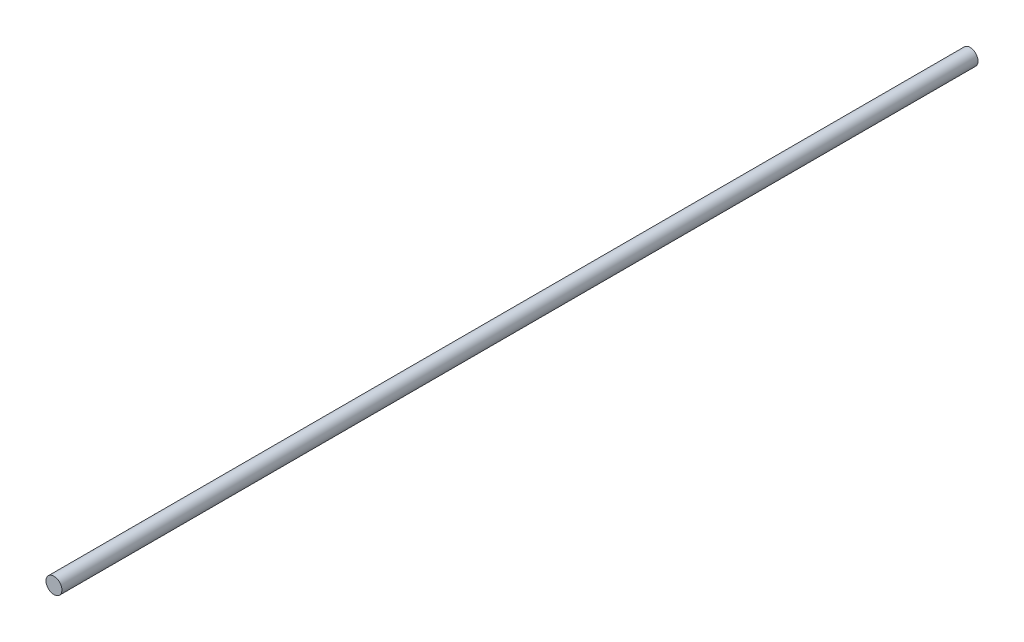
from build123d import *

# Parameters (mm, degrees)
SKETCH1_R           = 30
BOSS_EXTRUDE1_DEPTH = 3450


with BuildPart() as part:
    # Sketch1 → Boss-Extrude1 (new body)
    with BuildSketch(Plane.XY):
        Circle(SKETCH1_R)
    extrude(amount=-BOSS_EXTRUDE1_DEPTH)


solid = part.part
